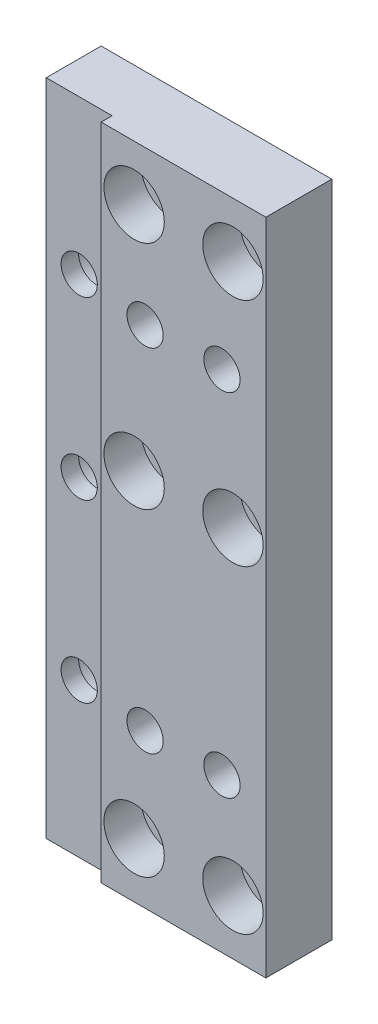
ISO-10303-21;
HEADER;
FILE_DESCRIPTION(('STEP AP214'),'2;1');
FILE_NAME('part.step','',(''),(''),'','','');
FILE_SCHEMA(('AUTOMOTIVE_DESIGN { 1 0 10303 214 1 1 1 1 }'));
ENDSEC;
DATA;
#1=APPLICATION_CONTEXT('core data for automotive mechanical design processes');
#2=APPLICATION_PROTOCOL_DEFINITION('international standard','automotive_design',2000,#1);
#3=PRODUCT_CONTEXT('',#1,'mechanical');
#4=PRODUCT('Part','Part','',(#3));
#5=PRODUCT_RELATED_PRODUCT_CATEGORY('part','',(#4));
#6=PRODUCT_DEFINITION_FORMATION('','',#4);
#7=PRODUCT_DEFINITION_CONTEXT('part definition',#1,'design');
#8=PRODUCT_DEFINITION('design','',#6,#7);
#9=PRODUCT_DEFINITION_SHAPE('','',#8);
#10=(LENGTH_UNIT() NAMED_UNIT(*) SI_UNIT(.MILLI.,.METRE.));
#11=(NAMED_UNIT(*) PLANE_ANGLE_UNIT() SI_UNIT($,.RADIAN.));
#12=(NAMED_UNIT(*) SI_UNIT($,.STERADIAN.) SOLID_ANGLE_UNIT());
#13=UNCERTAINTY_MEASURE_WITH_UNIT(LENGTH_MEASURE(1.E-05),#10,'distance_accuracy_value','');
#14=(GEOMETRIC_REPRESENTATION_CONTEXT(3) GLOBAL_UNCERTAINTY_ASSIGNED_CONTEXT((#13)) GLOBAL_UNIT_ASSIGNED_CONTEXT((#10,
#11,#12)) REPRESENTATION_CONTEXT('',''));
#15=CARTESIAN_POINT('',(0.,0.,0.));
#16=DIRECTION('',(0.,0.,1.));
#17=DIRECTION('',(1.,0.,0.));
#18=AXIS2_PLACEMENT_3D('',#15,#16,#17);
#19=CARTESIAN_POINT('',(-30.,60.,12.));
#20=DIRECTION('',(0.,-1.,0.));
#21=DIRECTION('',(0.,0.,-1.));
#22=AXIS2_PLACEMENT_3D('',#19,#20,#21);
#23=PLANE('',#22);
#24=DIRECTION('',(-1.,0.,0.));
#25=VECTOR('',#24,1.);
#26=CARTESIAN_POINT('',(-30.,60.,12.));
#27=LINE('',#26,#25);
#28=CARTESIAN_POINT('',(12.,60.,12.));
#29=VERTEX_POINT('',#28);
#30=CARTESIAN_POINT('',(-18.,60.,12.));
#31=VERTEX_POINT('',#30);
#32=EDGE_CURVE('E88',#29,#31,#27,.T.);
#33=ORIENTED_EDGE('',*,*,#32,.F.);
#34=DIRECTION('',(0.,0.,-1.));
#35=VECTOR('',#34,1.);
#36=CARTESIAN_POINT('',(12.,60.,12.));
#37=LINE('',#36,#35);
#38=CARTESIAN_POINT('',(12.,60.,0.));
#39=VERTEX_POINT('',#38);
#40=EDGE_CURVE('E72',#29,#39,#37,.T.);
#41=ORIENTED_EDGE('',*,*,#40,.T.);
#42=DIRECTION('',(-1.,0.,0.));
#43=VECTOR('',#42,1.);
#44=CARTESIAN_POINT('',(-30.,60.,0.));
#45=LINE('',#44,#43);
#46=CARTESIAN_POINT('',(-30.,60.,0.));
#47=VERTEX_POINT('',#46);
#48=EDGE_CURVE('E94',#39,#47,#45,.T.);
#49=ORIENTED_EDGE('',*,*,#48,.T.);
#50=DIRECTION('',(0.,0.,-1.));
#51=VECTOR('',#50,1.);
#52=CARTESIAN_POINT('',(-30.,60.,12.));
#53=LINE('',#52,#51);
#54=CARTESIAN_POINT('',(-30.,60.,10.));
#55=VERTEX_POINT('',#54);
#56=EDGE_CURVE('E24',#55,#47,#53,.T.);
#57=ORIENTED_EDGE('',*,*,#56,.F.);
#58=DIRECTION('',(1.,0.,0.));
#59=VECTOR('',#58,1.);
#60=CARTESIAN_POINT('',(-18.,60.,10.));
#61=LINE('',#60,#59);
#62=CARTESIAN_POINT('',(-18.,60.,10.));
#63=VERTEX_POINT('',#62);
#64=EDGE_CURVE('E182',#55,#63,#61,.T.);
#65=ORIENTED_EDGE('',*,*,#64,.T.);
#66=DIRECTION('',(0.,0.,1.));
#67=VECTOR('',#66,1.);
#68=CARTESIAN_POINT('',(-18.,60.,10.));
#69=LINE('',#68,#67);
#70=EDGE_CURVE('E179',#63,#31,#69,.T.);
#71=ORIENTED_EDGE('',*,*,#70,.T.);
#72=EDGE_LOOP('',(#33,#41,#49,#57,#65,#71));
#73=FACE_BOUND('',#72,.T.);
#74=ADVANCED_FACE('F16',(#73),#23,.F.);
#75=CARTESIAN_POINT('',(-30.,60.,12.));
#76=DIRECTION('',(1.,0.,0.));
#77=DIRECTION('',(0.,1.,0.));
#78=AXIS2_PLACEMENT_3D('',#75,#76,#77);
#79=PLANE('',#78);
#80=DIRECTION('',(0.,0.,-1.));
#81=VECTOR('',#80,1.);
#82=CARTESIAN_POINT('',(-30.,-60.,12.));
#83=LINE('',#82,#81);
#84=CARTESIAN_POINT('',(-30.,-60.,10.));
#85=VERTEX_POINT('',#84);
#86=CARTESIAN_POINT('',(-30.,-60.,0.));
#87=VERTEX_POINT('',#86);
#88=EDGE_CURVE('E87',#85,#87,#83,.T.);
#89=ORIENTED_EDGE('',*,*,#88,.F.);
#90=DIRECTION('',(0.,1.,0.));
#91=VECTOR('',#90,1.);
#92=CARTESIAN_POINT('',(-30.,60.,10.));
#93=LINE('',#92,#91);
#94=EDGE_CURVE('E97',#85,#55,#93,.T.);
#95=ORIENTED_EDGE('',*,*,#94,.T.);
#96=ORIENTED_EDGE('',*,*,#56,.T.);
#97=DIRECTION('',(0.,-1.,0.));
#98=VECTOR('',#97,1.);
#99=CARTESIAN_POINT('',(-30.,60.,0.));
#100=LINE('',#99,#98);
#101=EDGE_CURVE('E96',#47,#87,#100,.T.);
#102=ORIENTED_EDGE('',*,*,#101,.T.);
#103=EDGE_LOOP('',(#89,#95,#96,#102));
#104=FACE_BOUND('',#103,.T.);
#105=ADVANCED_FACE('F193',(#104),#79,.F.);
#106=CARTESIAN_POINT('',(-30.,-60.,12.));
#107=DIRECTION('',(0.,1.,0.));
#108=DIRECTION('',(0.,0.,1.));
#109=AXIS2_PLACEMENT_3D('',#106,#107,#108);
#110=PLANE('',#109);
#111=DIRECTION('',(1.,0.,0.));
#112=VECTOR('',#111,1.);
#113=CARTESIAN_POINT('',(-30.,-60.,0.));
#114=LINE('',#113,#112);
#115=CARTESIAN_POINT('',(12.,-60.,0.));
#116=VERTEX_POINT('',#115);
#117=EDGE_CURVE('E84',#87,#116,#114,.T.);
#118=ORIENTED_EDGE('',*,*,#117,.T.);
#119=DIRECTION('',(0.,0.,-1.));
#120=VECTOR('',#119,1.);
#121=CARTESIAN_POINT('',(12.,-60.,12.));
#122=LINE('',#121,#120);
#123=CARTESIAN_POINT('',(12.,-60.,12.));
#124=VERTEX_POINT('',#123);
#125=EDGE_CURVE('E32',#124,#116,#122,.T.);
#126=ORIENTED_EDGE('',*,*,#125,.F.);
#127=DIRECTION('',(1.,0.,0.));
#128=VECTOR('',#127,1.);
#129=CARTESIAN_POINT('',(-30.,-60.,12.));
#130=LINE('',#129,#128);
#131=CARTESIAN_POINT('',(-18.,-60.,12.));
#132=VERTEX_POINT('',#131);
#133=EDGE_CURVE('E82',#132,#124,#130,.T.);
#134=ORIENTED_EDGE('',*,*,#133,.F.);
#135=DIRECTION('',(0.,0.,1.));
#136=VECTOR('',#135,1.);
#137=CARTESIAN_POINT('',(-18.,-60.,10.));
#138=LINE('',#137,#136);
#139=CARTESIAN_POINT('',(-18.,-60.,10.));
#140=VERTEX_POINT('',#139);
#141=EDGE_CURVE('E39',#140,#132,#138,.T.);
#142=ORIENTED_EDGE('',*,*,#141,.F.);
#143=DIRECTION('',(1.,0.,0.));
#144=VECTOR('',#143,1.);
#145=CARTESIAN_POINT('',(-18.,-60.,10.));
#146=LINE('',#145,#144);
#147=EDGE_CURVE('E183',#85,#140,#146,.T.);
#148=ORIENTED_EDGE('',*,*,#147,.F.);
#149=ORIENTED_EDGE('',*,*,#88,.T.);
#150=EDGE_LOOP('',(#118,#126,#134,#142,#148,#149));
#151=FACE_BOUND('',#150,.T.);
#152=ADVANCED_FACE('F81',(#151),#110,.F.);
#153=CARTESIAN_POINT('',(0.,0.,12.));
#154=DIRECTION('',(0.,0.,1.));
#155=DIRECTION('',(1.,0.,0.));
#156=AXIS2_PLACEMENT_3D('',#153,#154,#155);
#157=PLANE('',#156);
#158=CARTESIAN_POINT('',(-12.,-50.,12.));
#159=DIRECTION('',(0.,0.,1.));
#160=DIRECTION('',(1.,0.,0.));
#161=AXIS2_PLACEMENT_3D('',#158,#159,#160);
#162=CIRCLE('',#161,5.5);
#163=CARTESIAN_POINT('',(-6.5,-50.,12.));
#164=VERTEX_POINT('',#163);
#165=EDGE_CURVE('E667',#164,#164,#162,.T.);
#166=ORIENTED_EDGE('',*,*,#165,.F.);
#167=EDGE_LOOP('',(#166));
#168=FACE_BOUND('',#167,.T.);
#169=CARTESIAN_POINT('',(6.,-50.,12.));
#170=DIRECTION('',(0.,0.,1.));
#171=DIRECTION('',(1.,0.,0.));
#172=AXIS2_PLACEMENT_3D('',#169,#170,#171);
#173=CIRCLE('',#172,5.5);
#174=CARTESIAN_POINT('',(11.5,-50.,12.));
#175=VERTEX_POINT('',#174);
#176=EDGE_CURVE('E676',#175,#175,#173,.T.);
#177=ORIENTED_EDGE('',*,*,#176,.F.);
#178=EDGE_LOOP('',(#177));
#179=FACE_BOUND('',#178,.T.);
#180=CARTESIAN_POINT('',(-12.,50.,12.));
#181=DIRECTION('',(0.,0.,1.));
#182=DIRECTION('',(1.,0.,0.));
#183=AXIS2_PLACEMENT_3D('',#180,#181,#182);
#184=CIRCLE('',#183,5.5);
#185=CARTESIAN_POINT('',(-6.5,50.,12.));
#186=VERTEX_POINT('',#185);
#187=EDGE_CURVE('E688',#186,#186,#184,.T.);
#188=ORIENTED_EDGE('',*,*,#187,.F.);
#189=EDGE_LOOP('',(#188));
#190=FACE_BOUND('',#189,.T.);
#191=CARTESIAN_POINT('',(6.,50.,12.));
#192=DIRECTION('',(0.,0.,1.));
#193=DIRECTION('',(1.,0.,0.));
#194=AXIS2_PLACEMENT_3D('',#191,#192,#193);
#195=CIRCLE('',#194,5.5);
#196=CARTESIAN_POINT('',(11.5,50.,12.));
#197=VERTEX_POINT('',#196);
#198=EDGE_CURVE('E700',#197,#197,#195,.T.);
#199=ORIENTED_EDGE('',*,*,#198,.F.);
#200=EDGE_LOOP('',(#199));
#201=FACE_BOUND('',#200,.T.);
#202=CARTESIAN_POINT('',(6.,8.,12.));
#203=DIRECTION('',(0.,0.,1.));
#204=DIRECTION('',(1.,0.,0.));
#205=AXIS2_PLACEMENT_3D('',#202,#203,#204);
#206=CIRCLE('',#205,5.5);
#207=CARTESIAN_POINT('',(11.5,8.,12.));
#208=VERTEX_POINT('',#207);
#209=EDGE_CURVE('E712',#208,#208,#206,.T.);
#210=ORIENTED_EDGE('',*,*,#209,.F.);
#211=EDGE_LOOP('',(#210));
#212=FACE_BOUND('',#211,.T.);
#213=CARTESIAN_POINT('',(-12.,8.,12.));
#214=DIRECTION('',(0.,0.,1.));
#215=DIRECTION('',(1.,0.,0.));
#216=AXIS2_PLACEMENT_3D('',#213,#214,#215);
#217=CIRCLE('',#216,5.5);
#218=CARTESIAN_POINT('',(-6.5,8.,12.));
#219=VERTEX_POINT('',#218);
#220=EDGE_CURVE('E724',#219,#219,#217,.T.);
#221=ORIENTED_EDGE('',*,*,#220,.F.);
#222=EDGE_LOOP('',(#221));
#223=FACE_BOUND('',#222,.T.);
#224=CARTESIAN_POINT('',(-10.,-32.,12.));
#225=DIRECTION('',(0.,0.,-1.));
#226=DIRECTION('',(-1.,0.,0.));
#227=AXIS2_PLACEMENT_3D('',#224,#225,#226);
#228=CIRCLE('',#227,3.3);
#229=CARTESIAN_POINT('',(-13.3,-32.,12.));
#230=VERTEX_POINT('',#229);
#231=EDGE_CURVE('E138',#230,#230,#228,.T.);
#232=ORIENTED_EDGE('',*,*,#231,.T.);
#233=EDGE_LOOP('',(#232));
#234=FACE_BOUND('',#233,.T.);
#235=CARTESIAN_POINT('',(4.,-32.,12.));
#236=DIRECTION('',(0.,0.,-1.));
#237=DIRECTION('',(-1.,0.,0.));
#238=AXIS2_PLACEMENT_3D('',#235,#236,#237);
#239=CIRCLE('',#238,3.3);
#240=CARTESIAN_POINT('',(0.7,-32.,12.));
#241=VERTEX_POINT('',#240);
#242=EDGE_CURVE('E150',#241,#241,#239,.T.);
#243=ORIENTED_EDGE('',*,*,#242,.T.);
#244=EDGE_LOOP('',(#243));
#245=FACE_BOUND('',#244,.T.);
#246=CARTESIAN_POINT('',(-10.,32.,12.));
#247=DIRECTION('',(0.,0.,-1.));
#248=DIRECTION('',(-1.,0.,0.));
#249=AXIS2_PLACEMENT_3D('',#246,#247,#248);
#250=CIRCLE('',#249,3.3);
#251=CARTESIAN_POINT('',(-13.3,32.,12.));
#252=VERTEX_POINT('',#251);
#253=EDGE_CURVE('E162',#252,#252,#250,.T.);
#254=ORIENTED_EDGE('',*,*,#253,.T.);
#255=EDGE_LOOP('',(#254));
#256=FACE_BOUND('',#255,.T.);
#257=CARTESIAN_POINT('',(4.,32.,12.));
#258=DIRECTION('',(0.,0.,-1.));
#259=DIRECTION('',(-1.,0.,0.));
#260=AXIS2_PLACEMENT_3D('',#257,#258,#259);
#261=CIRCLE('',#260,3.3);
#262=CARTESIAN_POINT('',(0.7,32.,12.));
#263=VERTEX_POINT('',#262);
#264=EDGE_CURVE('E174',#263,#263,#261,.T.);
#265=ORIENTED_EDGE('',*,*,#264,.T.);
#266=EDGE_LOOP('',(#265));
#267=FACE_BOUND('',#266,.T.);
#268=DIRECTION('',(0.,1.,0.));
#269=VECTOR('',#268,1.);
#270=CARTESIAN_POINT('',(12.,60.,12.));
#271=LINE('',#270,#269);
#272=EDGE_CURVE('E69',#124,#29,#271,.T.);
#273=ORIENTED_EDGE('',*,*,#272,.T.);
#274=ORIENTED_EDGE('',*,*,#32,.T.);
#275=DIRECTION('',(0.,1.,0.));
#276=VECTOR('',#275,1.);
#277=CARTESIAN_POINT('',(-18.,0.,12.));
#278=LINE('',#277,#276);
#279=EDGE_CURVE('E11',#132,#31,#278,.T.);
#280=ORIENTED_EDGE('',*,*,#279,.F.);
#281=ORIENTED_EDGE('',*,*,#133,.T.);
#282=EDGE_LOOP('',(#273,#274,#280,#281));
#283=FACE_BOUND('',#282,.T.);
#284=ADVANCED_FACE('F86',(#168,#179,#190,#201,#212,#223,#234,#245,#256,#267,#283),#157,.T.);
#285=CARTESIAN_POINT('',(0.,0.,0.));
#286=DIRECTION('',(0.,0.,1.));
#287=DIRECTION('',(1.,0.,0.));
#288=AXIS2_PLACEMENT_3D('',#285,#286,#287);
#289=PLANE('',#288);
#290=CARTESIAN_POINT('',(-12.,-50.,0.));
#291=DIRECTION('',(0.,0.,1.));
#292=DIRECTION('',(1.,0.,0.));
#293=AXIS2_PLACEMENT_3D('',#290,#291,#292);
#294=CIRCLE('',#293,3.3);
#295=CARTESIAN_POINT('',(-8.7,-50.,0.));
#296=VERTEX_POINT('',#295);
#297=EDGE_CURVE('E674',#296,#296,#294,.T.);
#298=ORIENTED_EDGE('',*,*,#297,.T.);
#299=EDGE_LOOP('',(#298));
#300=FACE_BOUND('',#299,.T.);
#301=CARTESIAN_POINT('',(6.,-50.,0.));
#302=DIRECTION('',(0.,0.,1.));
#303=DIRECTION('',(1.,0.,0.));
#304=AXIS2_PLACEMENT_3D('',#301,#302,#303);
#305=CIRCLE('',#304,3.3);
#306=CARTESIAN_POINT('',(9.3,-50.,0.));
#307=VERTEX_POINT('',#306);
#308=EDGE_CURVE('E685',#307,#307,#305,.T.);
#309=ORIENTED_EDGE('',*,*,#308,.T.);
#310=EDGE_LOOP('',(#309));
#311=FACE_BOUND('',#310,.T.);
#312=CARTESIAN_POINT('',(-12.,50.,0.));
#313=DIRECTION('',(0.,0.,1.));
#314=DIRECTION('',(1.,0.,0.));
#315=AXIS2_PLACEMENT_3D('',#312,#313,#314);
#316=CIRCLE('',#315,3.3);
#317=CARTESIAN_POINT('',(-8.7,50.,0.));
#318=VERTEX_POINT('',#317);
#319=EDGE_CURVE('E697',#318,#318,#316,.T.);
#320=ORIENTED_EDGE('',*,*,#319,.T.);
#321=EDGE_LOOP('',(#320));
#322=FACE_BOUND('',#321,.T.);
#323=CARTESIAN_POINT('',(6.,50.,0.));
#324=DIRECTION('',(0.,0.,1.));
#325=DIRECTION('',(1.,0.,0.));
#326=AXIS2_PLACEMENT_3D('',#323,#324,#325);
#327=CIRCLE('',#326,3.3);
#328=CARTESIAN_POINT('',(9.3,50.,0.));
#329=VERTEX_POINT('',#328);
#330=EDGE_CURVE('E709',#329,#329,#327,.T.);
#331=ORIENTED_EDGE('',*,*,#330,.T.);
#332=EDGE_LOOP('',(#331));
#333=FACE_BOUND('',#332,.T.);
#334=CARTESIAN_POINT('',(6.,8.,0.));
#335=DIRECTION('',(0.,0.,1.));
#336=DIRECTION('',(1.,0.,0.));
#337=AXIS2_PLACEMENT_3D('',#334,#335,#336);
#338=CIRCLE('',#337,3.3);
#339=CARTESIAN_POINT('',(9.3,8.,0.));
#340=VERTEX_POINT('',#339);
#341=EDGE_CURVE('E721',#340,#340,#338,.T.);
#342=ORIENTED_EDGE('',*,*,#341,.T.);
#343=EDGE_LOOP('',(#342));
#344=FACE_BOUND('',#343,.T.);
#345=CARTESIAN_POINT('',(-12.,8.,0.));
#346=DIRECTION('',(0.,0.,1.));
#347=DIRECTION('',(1.,0.,0.));
#348=AXIS2_PLACEMENT_3D('',#345,#346,#347);
#349=CIRCLE('',#348,3.3);
#350=CARTESIAN_POINT('',(-8.7,8.,0.));
#351=VERTEX_POINT('',#350);
#352=EDGE_CURVE('E733',#351,#351,#349,.T.);
#353=ORIENTED_EDGE('',*,*,#352,.T.);
#354=EDGE_LOOP('',(#353));
#355=FACE_BOUND('',#354,.T.);
#356=CARTESIAN_POINT('',(-24.,32.,0.));
#357=DIRECTION('',(0.,0.,-1.));
#358=DIRECTION('',(-1.,0.,0.));
#359=AXIS2_PLACEMENT_3D('',#356,#357,#358);
#360=CIRCLE('',#359,5.5);
#361=CARTESIAN_POINT('',(-29.5,32.,0.));
#362=VERTEX_POINT('',#361);
#363=EDGE_CURVE('E736',#362,#362,#360,.T.);
#364=ORIENTED_EDGE('',*,*,#363,.F.);
#365=EDGE_LOOP('',(#364));
#366=FACE_BOUND('',#365,.T.);
#367=CARTESIAN_POINT('',(-24.,0.,0.));
#368=DIRECTION('',(0.,0.,-1.));
#369=DIRECTION('',(-1.,0.,0.));
#370=AXIS2_PLACEMENT_3D('',#367,#368,#369);
#371=CIRCLE('',#370,5.5);
#372=CARTESIAN_POINT('',(-29.5,0.,0.));
#373=VERTEX_POINT('',#372);
#374=EDGE_CURVE('E122',#373,#373,#371,.T.);
#375=ORIENTED_EDGE('',*,*,#374,.F.);
#376=EDGE_LOOP('',(#375));
#377=FACE_BOUND('',#376,.T.);
#378=CARTESIAN_POINT('',(-24.,-32.,0.));
#379=DIRECTION('',(0.,0.,-1.));
#380=DIRECTION('',(-1.,0.,0.));
#381=AXIS2_PLACEMENT_3D('',#378,#379,#380);
#382=CIRCLE('',#381,5.5);
#383=CARTESIAN_POINT('',(-29.5,-32.,0.));
#384=VERTEX_POINT('',#383);
#385=EDGE_CURVE('E109',#384,#384,#382,.T.);
#386=ORIENTED_EDGE('',*,*,#385,.F.);
#387=EDGE_LOOP('',(#386));
#388=FACE_BOUND('',#387,.T.);
#389=CARTESIAN_POINT('',(-10.,-32.,0.));
#390=DIRECTION('',(0.,0.,-1.));
#391=DIRECTION('',(-1.,0.,0.));
#392=AXIS2_PLACEMENT_3D('',#389,#390,#391);
#393=CIRCLE('',#392,5.5);
#394=CARTESIAN_POINT('',(-15.5,-32.,0.));
#395=VERTEX_POINT('',#394);
#396=EDGE_CURVE('E105',#395,#395,#393,.T.);
#397=ORIENTED_EDGE('',*,*,#396,.F.);
#398=EDGE_LOOP('',(#397));
#399=FACE_BOUND('',#398,.T.);
#400=CARTESIAN_POINT('',(4.,-32.,0.));
#401=DIRECTION('',(0.,0.,-1.));
#402=DIRECTION('',(-1.,0.,0.));
#403=AXIS2_PLACEMENT_3D('',#400,#401,#402);
#404=CIRCLE('',#403,5.5);
#405=CARTESIAN_POINT('',(-1.5,-32.,0.));
#406=VERTEX_POINT('',#405);
#407=EDGE_CURVE('E141',#406,#406,#404,.T.);
#408=ORIENTED_EDGE('',*,*,#407,.F.);
#409=EDGE_LOOP('',(#408));
#410=FACE_BOUND('',#409,.T.);
#411=CARTESIAN_POINT('',(-10.,32.,0.));
#412=DIRECTION('',(0.,0.,-1.));
#413=DIRECTION('',(-1.,0.,0.));
#414=AXIS2_PLACEMENT_3D('',#411,#412,#413);
#415=CIRCLE('',#414,5.5);
#416=CARTESIAN_POINT('',(-15.5,32.,0.));
#417=VERTEX_POINT('',#416);
#418=EDGE_CURVE('E153',#417,#417,#415,.T.);
#419=ORIENTED_EDGE('',*,*,#418,.F.);
#420=EDGE_LOOP('',(#419));
#421=FACE_BOUND('',#420,.T.);
#422=CARTESIAN_POINT('',(4.,32.,0.));
#423=DIRECTION('',(0.,0.,-1.));
#424=DIRECTION('',(-1.,0.,0.));
#425=AXIS2_PLACEMENT_3D('',#422,#423,#424);
#426=CIRCLE('',#425,5.5);
#427=CARTESIAN_POINT('',(-1.5,32.,0.));
#428=VERTEX_POINT('',#427);
#429=EDGE_CURVE('E165',#428,#428,#426,.T.);
#430=ORIENTED_EDGE('',*,*,#429,.F.);
#431=EDGE_LOOP('',(#430));
#432=FACE_BOUND('',#431,.T.);
#433=ORIENTED_EDGE('',*,*,#48,.F.);
#434=DIRECTION('',(0.,1.,0.));
#435=VECTOR('',#434,1.);
#436=CARTESIAN_POINT('',(12.,60.,0.));
#437=LINE('',#436,#435);
#438=EDGE_CURVE('E76',#116,#39,#437,.T.);
#439=ORIENTED_EDGE('',*,*,#438,.F.);
#440=ORIENTED_EDGE('',*,*,#117,.F.);
#441=ORIENTED_EDGE('',*,*,#101,.F.);
#442=EDGE_LOOP('',(#433,#439,#440,#441));
#443=FACE_BOUND('',#442,.T.);
#444=ADVANCED_FACE('F200',(#300,#311,#322,#333,#344,#355,#366,#377,#388,#399,#410,#421,#432,
#443),#289,.F.);
#445=CARTESIAN_POINT('',(-18.,60.,10.));
#446=DIRECTION('',(0.,0.,-1.));
#447=DIRECTION('',(-1.,0.,0.));
#448=AXIS2_PLACEMENT_3D('',#445,#446,#447);
#449=PLANE('',#448);
#450=CARTESIAN_POINT('',(-24.,32.,10.));
#451=DIRECTION('',(0.,0.,-1.));
#452=DIRECTION('',(-1.,0.,0.));
#453=AXIS2_PLACEMENT_3D('',#450,#451,#452);
#454=CIRCLE('',#453,3.3);
#455=CARTESIAN_POINT('',(-27.3,32.,10.));
#456=VERTEX_POINT('',#455);
#457=EDGE_CURVE('E19',#456,#456,#454,.T.);
#458=ORIENTED_EDGE('',*,*,#457,.T.);
#459=EDGE_LOOP('',(#458));
#460=FACE_BOUND('',#459,.T.);
#461=CARTESIAN_POINT('',(-24.,0.,10.));
#462=DIRECTION('',(0.,0.,-1.));
#463=DIRECTION('',(-1.,0.,0.));
#464=AXIS2_PLACEMENT_3D('',#461,#462,#463);
#465=CIRCLE('',#464,3.3);
#466=CARTESIAN_POINT('',(-27.3,0.,10.));
#467=VERTEX_POINT('',#466);
#468=EDGE_CURVE('E107',#467,#467,#465,.T.);
#469=ORIENTED_EDGE('',*,*,#468,.T.);
#470=EDGE_LOOP('',(#469));
#471=FACE_BOUND('',#470,.T.);
#472=CARTESIAN_POINT('',(-24.,-32.,10.));
#473=DIRECTION('',(0.,0.,-1.));
#474=DIRECTION('',(-1.,0.,0.));
#475=AXIS2_PLACEMENT_3D('',#472,#473,#474);
#476=CIRCLE('',#475,3.3);
#477=CARTESIAN_POINT('',(-27.3,-32.,10.));
#478=VERTEX_POINT('',#477);
#479=EDGE_CURVE('E103',#478,#478,#476,.T.);
#480=ORIENTED_EDGE('',*,*,#479,.T.);
#481=EDGE_LOOP('',(#480));
#482=FACE_BOUND('',#481,.T.);
#483=ORIENTED_EDGE('',*,*,#147,.T.);
#484=DIRECTION('',(0.,-1.,0.));
#485=VECTOR('',#484,1.);
#486=CARTESIAN_POINT('',(-18.,60.,10.));
#487=LINE('',#486,#485);
#488=EDGE_CURVE('E186',#63,#140,#487,.T.);
#489=ORIENTED_EDGE('',*,*,#488,.F.);
#490=ORIENTED_EDGE('',*,*,#64,.F.);
#491=ORIENTED_EDGE('',*,*,#94,.F.);
#492=EDGE_LOOP('',(#483,#489,#490,#491));
#493=FACE_BOUND('',#492,.T.);
#494=ADVANCED_FACE('F202',(#460,#471,#482,#493),#449,.F.);
#495=CARTESIAN_POINT('',(-18.,60.,10.));
#496=DIRECTION('',(1.,0.,0.));
#497=DIRECTION('',(0.,0.,-1.));
#498=AXIS2_PLACEMENT_3D('',#495,#496,#497);
#499=PLANE('',#498);
#500=ORIENTED_EDGE('',*,*,#279,.T.);
#501=ORIENTED_EDGE('',*,*,#70,.F.);
#502=ORIENTED_EDGE('',*,*,#488,.T.);
#503=ORIENTED_EDGE('',*,*,#141,.T.);
#504=EDGE_LOOP('',(#500,#501,#502,#503));
#505=FACE_BOUND('',#504,.T.);
#506=ADVANCED_FACE('F211',(#505),#499,.F.);
#507=CARTESIAN_POINT('',(12.,60.,12.));
#508=DIRECTION('',(-1.,0.,0.));
#509=DIRECTION('',(0.,-1.,0.));
#510=AXIS2_PLACEMENT_3D('',#507,#508,#509);
#511=PLANE('',#510);
#512=ORIENTED_EDGE('',*,*,#438,.T.);
#513=ORIENTED_EDGE('',*,*,#40,.F.);
#514=ORIENTED_EDGE('',*,*,#272,.F.);
#515=ORIENTED_EDGE('',*,*,#125,.T.);
#516=EDGE_LOOP('',(#512,#513,#514,#515));
#517=FACE_BOUND('',#516,.T.);
#518=ADVANCED_FACE('F70',(#517),#511,.F.);
#519=CARTESIAN_POINT('',(4.,32.,0.));
#520=DIRECTION('',(0.,0.,-1.));
#521=DIRECTION('',(-1.,0.,0.));
#522=AXIS2_PLACEMENT_3D('',#519,#520,#521);
#523=CYLINDRICAL_SURFACE('',#522,3.3);
#524=ORIENTED_EDGE('',*,*,#264,.F.);
#525=EDGE_LOOP('',(#524));
#526=FACE_BOUND('',#525,.T.);
#527=CARTESIAN_POINT('',(4.,32.,6.8));
#528=DIRECTION('',(0.,0.,-1.));
#529=DIRECTION('',(-1.,0.,0.));
#530=AXIS2_PLACEMENT_3D('',#527,#528,#529);
#531=CIRCLE('',#530,3.3);
#532=CARTESIAN_POINT('',(0.7,32.,6.8));
#533=VERTEX_POINT('',#532);
#534=EDGE_CURVE('E171',#533,#533,#531,.T.);
#535=ORIENTED_EDGE('',*,*,#534,.T.);
#536=EDGE_LOOP('',(#535));
#537=FACE_BOUND('',#536,.T.);
#538=ADVANCED_FACE('F267',(#526,#537),#523,.F.);
#539=CARTESIAN_POINT('',(7.3,32.,6.8));
#540=DIRECTION('',(0.,0.,1.));
#541=DIRECTION('',(1.,0.,0.));
#542=AXIS2_PLACEMENT_3D('',#539,#540,#541);
#543=PLANE('',#542);
#544=ORIENTED_EDGE('',*,*,#534,.F.);
#545=EDGE_LOOP('',(#544));
#546=FACE_BOUND('',#545,.T.);
#547=CARTESIAN_POINT('',(4.,32.,6.8));
#548=DIRECTION('',(0.,0.,-1.));
#549=DIRECTION('',(-1.,0.,0.));
#550=AXIS2_PLACEMENT_3D('',#547,#548,#549);
#551=CIRCLE('',#550,5.5);
#552=CARTESIAN_POINT('',(-1.5,32.,6.8));
#553=VERTEX_POINT('',#552);
#554=EDGE_CURVE('E168',#553,#553,#551,.T.);
#555=ORIENTED_EDGE('',*,*,#554,.T.);
#556=EDGE_LOOP('',(#555));
#557=FACE_BOUND('',#556,.T.);
#558=ADVANCED_FACE('F276',(#546,#557),#543,.F.);
#559=CARTESIAN_POINT('',(4.,32.,0.));
#560=DIRECTION('',(0.,0.,-1.));
#561=DIRECTION('',(-1.,0.,0.));
#562=AXIS2_PLACEMENT_3D('',#559,#560,#561);
#563=CYLINDRICAL_SURFACE('',#562,5.5);
#564=ORIENTED_EDGE('',*,*,#554,.F.);
#565=EDGE_LOOP('',(#564));
#566=FACE_BOUND('',#565,.T.);
#567=ORIENTED_EDGE('',*,*,#429,.T.);
#568=EDGE_LOOP('',(#567));
#569=FACE_BOUND('',#568,.T.);
#570=ADVANCED_FACE('F286',(#566,#569),#563,.F.);
#571=CARTESIAN_POINT('',(-10.,32.,0.));
#572=DIRECTION('',(0.,0.,-1.));
#573=DIRECTION('',(-1.,0.,0.));
#574=AXIS2_PLACEMENT_3D('',#571,#572,#573);
#575=CYLINDRICAL_SURFACE('',#574,3.3);
#576=ORIENTED_EDGE('',*,*,#253,.F.);
#577=EDGE_LOOP('',(#576));
#578=FACE_BOUND('',#577,.T.);
#579=CARTESIAN_POINT('',(-10.,32.,6.8));
#580=DIRECTION('',(0.,0.,-1.));
#581=DIRECTION('',(-1.,0.,0.));
#582=AXIS2_PLACEMENT_3D('',#579,#580,#581);
#583=CIRCLE('',#582,3.3);
#584=CARTESIAN_POINT('',(-13.3,32.,6.8));
#585=VERTEX_POINT('',#584);
#586=EDGE_CURVE('E159',#585,#585,#583,.T.);
#587=ORIENTED_EDGE('',*,*,#586,.T.);
#588=EDGE_LOOP('',(#587));
#589=FACE_BOUND('',#588,.T.);
#590=ADVANCED_FACE('F296',(#578,#589),#575,.F.);
#591=CARTESIAN_POINT('',(-6.7,32.,6.8));
#592=DIRECTION('',(0.,0.,1.));
#593=DIRECTION('',(1.,0.,0.));
#594=AXIS2_PLACEMENT_3D('',#591,#592,#593);
#595=PLANE('',#594);
#596=ORIENTED_EDGE('',*,*,#586,.F.);
#597=EDGE_LOOP('',(#596));
#598=FACE_BOUND('',#597,.T.);
#599=CARTESIAN_POINT('',(-10.,32.,6.8));
#600=DIRECTION('',(0.,0.,-1.));
#601=DIRECTION('',(-1.,0.,0.));
#602=AXIS2_PLACEMENT_3D('',#599,#600,#601);
#603=CIRCLE('',#602,5.5);
#604=CARTESIAN_POINT('',(-15.5,32.,6.8));
#605=VERTEX_POINT('',#604);
#606=EDGE_CURVE('E156',#605,#605,#603,.T.);
#607=ORIENTED_EDGE('',*,*,#606,.T.);
#608=EDGE_LOOP('',(#607));
#609=FACE_BOUND('',#608,.T.);
#610=ADVANCED_FACE('F306',(#598,#609),#595,.F.);
#611=CARTESIAN_POINT('',(-10.,32.,0.));
#612=DIRECTION('',(0.,0.,-1.));
#613=DIRECTION('',(-1.,0.,0.));
#614=AXIS2_PLACEMENT_3D('',#611,#612,#613);
#615=CYLINDRICAL_SURFACE('',#614,5.5);
#616=ORIENTED_EDGE('',*,*,#606,.F.);
#617=EDGE_LOOP('',(#616));
#618=FACE_BOUND('',#617,.T.);
#619=ORIENTED_EDGE('',*,*,#418,.T.);
#620=EDGE_LOOP('',(#619));
#621=FACE_BOUND('',#620,.T.);
#622=ADVANCED_FACE('F316',(#618,#621),#615,.F.);
#623=CARTESIAN_POINT('',(4.,-32.,0.));
#624=DIRECTION('',(0.,0.,-1.));
#625=DIRECTION('',(-1.,0.,0.));
#626=AXIS2_PLACEMENT_3D('',#623,#624,#625);
#627=CYLINDRICAL_SURFACE('',#626,3.3);
#628=ORIENTED_EDGE('',*,*,#242,.F.);
#629=EDGE_LOOP('',(#628));
#630=FACE_BOUND('',#629,.T.);
#631=CARTESIAN_POINT('',(4.,-32.,6.8));
#632=DIRECTION('',(0.,0.,-1.));
#633=DIRECTION('',(-1.,0.,0.));
#634=AXIS2_PLACEMENT_3D('',#631,#632,#633);
#635=CIRCLE('',#634,3.3);
#636=CARTESIAN_POINT('',(0.7,-32.,6.8));
#637=VERTEX_POINT('',#636);
#638=EDGE_CURVE('E147',#637,#637,#635,.T.);
#639=ORIENTED_EDGE('',*,*,#638,.T.);
#640=EDGE_LOOP('',(#639));
#641=FACE_BOUND('',#640,.T.);
#642=ADVANCED_FACE('F326',(#630,#641),#627,.F.);
#643=CARTESIAN_POINT('',(7.3,-32.,6.8));
#644=DIRECTION('',(0.,0.,1.));
#645=DIRECTION('',(1.,0.,0.));
#646=AXIS2_PLACEMENT_3D('',#643,#644,#645);
#647=PLANE('',#646);
#648=ORIENTED_EDGE('',*,*,#638,.F.);
#649=EDGE_LOOP('',(#648));
#650=FACE_BOUND('',#649,.T.);
#651=CARTESIAN_POINT('',(4.,-32.,6.8));
#652=DIRECTION('',(0.,0.,-1.));
#653=DIRECTION('',(-1.,0.,0.));
#654=AXIS2_PLACEMENT_3D('',#651,#652,#653);
#655=CIRCLE('',#654,5.5);
#656=CARTESIAN_POINT('',(-1.5,-32.,6.8));
#657=VERTEX_POINT('',#656);
#658=EDGE_CURVE('E144',#657,#657,#655,.T.);
#659=ORIENTED_EDGE('',*,*,#658,.T.);
#660=EDGE_LOOP('',(#659));
#661=FACE_BOUND('',#660,.T.);
#662=ADVANCED_FACE('F336',(#650,#661),#647,.F.);
#663=CARTESIAN_POINT('',(4.,-32.,0.));
#664=DIRECTION('',(0.,0.,-1.));
#665=DIRECTION('',(-1.,0.,0.));
#666=AXIS2_PLACEMENT_3D('',#663,#664,#665);
#667=CYLINDRICAL_SURFACE('',#666,5.5);
#668=ORIENTED_EDGE('',*,*,#658,.F.);
#669=EDGE_LOOP('',(#668));
#670=FACE_BOUND('',#669,.T.);
#671=ORIENTED_EDGE('',*,*,#407,.T.);
#672=EDGE_LOOP('',(#671));
#673=FACE_BOUND('',#672,.T.);
#674=ADVANCED_FACE('F346',(#670,#673),#667,.F.);
#675=CARTESIAN_POINT('',(-10.,-32.,0.));
#676=DIRECTION('',(0.,0.,-1.));
#677=DIRECTION('',(-1.,0.,0.));
#678=AXIS2_PLACEMENT_3D('',#675,#676,#677);
#679=CYLINDRICAL_SURFACE('',#678,3.3);
#680=ORIENTED_EDGE('',*,*,#231,.F.);
#681=EDGE_LOOP('',(#680));
#682=FACE_BOUND('',#681,.T.);
#683=CARTESIAN_POINT('',(-10.,-32.,6.8));
#684=DIRECTION('',(0.,0.,-1.));
#685=DIRECTION('',(-1.,0.,0.));
#686=AXIS2_PLACEMENT_3D('',#683,#684,#685);
#687=CIRCLE('',#686,3.3);
#688=CARTESIAN_POINT('',(-13.3,-32.,6.8));
#689=VERTEX_POINT('',#688);
#690=EDGE_CURVE('E135',#689,#689,#687,.T.);
#691=ORIENTED_EDGE('',*,*,#690,.T.);
#692=EDGE_LOOP('',(#691));
#693=FACE_BOUND('',#692,.T.);
#694=ADVANCED_FACE('F356',(#682,#693),#679,.F.);
#695=CARTESIAN_POINT('',(-6.7,-32.,6.8));
#696=DIRECTION('',(0.,0.,1.));
#697=DIRECTION('',(1.,0.,0.));
#698=AXIS2_PLACEMENT_3D('',#695,#696,#697);
#699=PLANE('',#698);
#700=ORIENTED_EDGE('',*,*,#690,.F.);
#701=EDGE_LOOP('',(#700));
#702=FACE_BOUND('',#701,.T.);
#703=CARTESIAN_POINT('',(-10.,-32.,6.8));
#704=DIRECTION('',(0.,0.,-1.));
#705=DIRECTION('',(-1.,0.,0.));
#706=AXIS2_PLACEMENT_3D('',#703,#704,#705);
#707=CIRCLE('',#706,5.5);
#708=CARTESIAN_POINT('',(-15.5,-32.,6.8));
#709=VERTEX_POINT('',#708);
#710=EDGE_CURVE('E132',#709,#709,#707,.T.);
#711=ORIENTED_EDGE('',*,*,#710,.T.);
#712=EDGE_LOOP('',(#711));
#713=FACE_BOUND('',#712,.T.);
#714=ADVANCED_FACE('F366',(#702,#713),#699,.F.);
#715=CARTESIAN_POINT('',(-10.,-32.,0.));
#716=DIRECTION('',(0.,0.,-1.));
#717=DIRECTION('',(-1.,0.,0.));
#718=AXIS2_PLACEMENT_3D('',#715,#716,#717);
#719=CYLINDRICAL_SURFACE('',#718,5.5);
#720=ORIENTED_EDGE('',*,*,#710,.F.);
#721=EDGE_LOOP('',(#720));
#722=FACE_BOUND('',#721,.T.);
#723=ORIENTED_EDGE('',*,*,#396,.T.);
#724=EDGE_LOOP('',(#723));
#725=FACE_BOUND('',#724,.T.);
#726=ADVANCED_FACE('F376',(#722,#725),#719,.F.);
#727=CARTESIAN_POINT('',(-24.,-32.,0.));
#728=DIRECTION('',(0.,0.,-1.));
#729=DIRECTION('',(-1.,0.,0.));
#730=AXIS2_PLACEMENT_3D('',#727,#728,#729);
#731=CYLINDRICAL_SURFACE('',#730,3.3);
#732=CARTESIAN_POINT('',(-24.,-32.,6.8));
#733=DIRECTION('',(0.,0.,-1.));
#734=DIRECTION('',(-1.,0.,0.));
#735=AXIS2_PLACEMENT_3D('',#732,#733,#734);
#736=CIRCLE('',#735,3.3);
#737=CARTESIAN_POINT('',(-27.3,-32.,6.8));
#738=VERTEX_POINT('',#737);
#739=EDGE_CURVE('E106',#738,#738,#736,.T.);
#740=ORIENTED_EDGE('',*,*,#739,.T.);
#741=EDGE_LOOP('',(#740));
#742=FACE_BOUND('',#741,.T.);
#743=ORIENTED_EDGE('',*,*,#479,.F.);
#744=EDGE_LOOP('',(#743));
#745=FACE_BOUND('',#744,.T.);
#746=ADVANCED_FACE('F386',(#742,#745),#731,.F.);
#747=CARTESIAN_POINT('',(-20.7,-32.,6.8));
#748=DIRECTION('',(0.,0.,1.));
#749=DIRECTION('',(1.,0.,0.));
#750=AXIS2_PLACEMENT_3D('',#747,#748,#749);
#751=PLANE('',#750);
#752=ORIENTED_EDGE('',*,*,#739,.F.);
#753=EDGE_LOOP('',(#752));
#754=FACE_BOUND('',#753,.T.);
#755=CARTESIAN_POINT('',(-24.,-32.,6.8));
#756=DIRECTION('',(0.,0.,-1.));
#757=DIRECTION('',(-1.,0.,0.));
#758=AXIS2_PLACEMENT_3D('',#755,#756,#757);
#759=CIRCLE('',#758,5.5);
#760=CARTESIAN_POINT('',(-29.5,-32.,6.8));
#761=VERTEX_POINT('',#760);
#762=EDGE_CURVE('E114',#761,#761,#759,.T.);
#763=ORIENTED_EDGE('',*,*,#762,.T.);
#764=EDGE_LOOP('',(#763));
#765=FACE_BOUND('',#764,.T.);
#766=ADVANCED_FACE('F396',(#754,#765),#751,.F.);
#767=CARTESIAN_POINT('',(-24.,-32.,0.));
#768=DIRECTION('',(0.,0.,-1.));
#769=DIRECTION('',(-1.,0.,0.));
#770=AXIS2_PLACEMENT_3D('',#767,#768,#769);
#771=CYLINDRICAL_SURFACE('',#770,5.5);
#772=ORIENTED_EDGE('',*,*,#762,.F.);
#773=EDGE_LOOP('',(#772));
#774=FACE_BOUND('',#773,.T.);
#775=ORIENTED_EDGE('',*,*,#385,.T.);
#776=EDGE_LOOP('',(#775));
#777=FACE_BOUND('',#776,.T.);
#778=ADVANCED_FACE('F406',(#774,#777),#771,.F.);
#779=CARTESIAN_POINT('',(-24.,0.,0.));
#780=DIRECTION('',(0.,0.,-1.));
#781=DIRECTION('',(-1.,0.,0.));
#782=AXIS2_PLACEMENT_3D('',#779,#780,#781);
#783=CYLINDRICAL_SURFACE('',#782,3.3);
#784=CARTESIAN_POINT('',(-24.,0.,6.8));
#785=DIRECTION('',(0.,0.,-1.));
#786=DIRECTION('',(-1.,0.,0.));
#787=AXIS2_PLACEMENT_3D('',#784,#785,#786);
#788=CIRCLE('',#787,3.3);
#789=CARTESIAN_POINT('',(-27.3,0.,6.8));
#790=VERTEX_POINT('',#789);
#791=EDGE_CURVE('E110',#790,#790,#788,.T.);
#792=ORIENTED_EDGE('',*,*,#791,.T.);
#793=EDGE_LOOP('',(#792));
#794=FACE_BOUND('',#793,.T.);
#795=ORIENTED_EDGE('',*,*,#468,.F.);
#796=EDGE_LOOP('',(#795));
#797=FACE_BOUND('',#796,.T.);
#798=ADVANCED_FACE('F416',(#794,#797),#783,.F.);
#799=CARTESIAN_POINT('',(-20.7,0.,6.8));
#800=DIRECTION('',(0.,0.,1.));
#801=DIRECTION('',(1.,0.,0.));
#802=AXIS2_PLACEMENT_3D('',#799,#800,#801);
#803=PLANE('',#802);
#804=ORIENTED_EDGE('',*,*,#791,.F.);
#805=EDGE_LOOP('',(#804));
#806=FACE_BOUND('',#805,.T.);
#807=CARTESIAN_POINT('',(-24.,0.,6.8));
#808=DIRECTION('',(0.,0.,-1.));
#809=DIRECTION('',(-1.,0.,0.));
#810=AXIS2_PLACEMENT_3D('',#807,#808,#809);
#811=CIRCLE('',#810,5.5);
#812=CARTESIAN_POINT('',(-29.5,0.,6.8));
#813=VERTEX_POINT('',#812);
#814=EDGE_CURVE('E117',#813,#813,#811,.T.);
#815=ORIENTED_EDGE('',*,*,#814,.T.);
#816=EDGE_LOOP('',(#815));
#817=FACE_BOUND('',#816,.T.);
#818=ADVANCED_FACE('F426',(#806,#817),#803,.F.);
#819=CARTESIAN_POINT('',(-24.,0.,0.));
#820=DIRECTION('',(0.,0.,-1.));
#821=DIRECTION('',(-1.,0.,0.));
#822=AXIS2_PLACEMENT_3D('',#819,#820,#821);
#823=CYLINDRICAL_SURFACE('',#822,5.5);
#824=ORIENTED_EDGE('',*,*,#814,.F.);
#825=EDGE_LOOP('',(#824));
#826=FACE_BOUND('',#825,.T.);
#827=ORIENTED_EDGE('',*,*,#374,.T.);
#828=EDGE_LOOP('',(#827));
#829=FACE_BOUND('',#828,.T.);
#830=ADVANCED_FACE('F435',(#826,#829),#823,.F.);
#831=CARTESIAN_POINT('',(-24.,32.,0.));
#832=DIRECTION('',(0.,0.,-1.));
#833=DIRECTION('',(-1.,0.,0.));
#834=AXIS2_PLACEMENT_3D('',#831,#832,#833);
#835=CYLINDRICAL_SURFACE('',#834,3.3);
#836=CARTESIAN_POINT('',(-24.,32.,6.8));
#837=DIRECTION('',(0.,0.,-1.));
#838=DIRECTION('',(-1.,0.,0.));
#839=AXIS2_PLACEMENT_3D('',#836,#837,#838);
#840=CIRCLE('',#839,3.3);
#841=CARTESIAN_POINT('',(-27.3,32.,6.8));
#842=VERTEX_POINT('',#841);
#843=EDGE_CURVE('E742',#842,#842,#840,.T.);
#844=ORIENTED_EDGE('',*,*,#843,.T.);
#845=EDGE_LOOP('',(#844));
#846=FACE_BOUND('',#845,.T.);
#847=ORIENTED_EDGE('',*,*,#457,.F.);
#848=EDGE_LOOP('',(#847));
#849=FACE_BOUND('',#848,.T.);
#850=ADVANCED_FACE('F445',(#846,#849),#835,.F.);
#851=CARTESIAN_POINT('',(-20.7,32.,6.8));
#852=DIRECTION('',(0.,0.,1.));
#853=DIRECTION('',(1.,0.,0.));
#854=AXIS2_PLACEMENT_3D('',#851,#852,#853);
#855=PLANE('',#854);
#856=ORIENTED_EDGE('',*,*,#843,.F.);
#857=EDGE_LOOP('',(#856));
#858=FACE_BOUND('',#857,.T.);
#859=CARTESIAN_POINT('',(-24.,32.,6.8));
#860=DIRECTION('',(0.,0.,-1.));
#861=DIRECTION('',(-1.,0.,0.));
#862=AXIS2_PLACEMENT_3D('',#859,#860,#861);
#863=CIRCLE('',#862,5.5);
#864=CARTESIAN_POINT('',(-29.5,32.,6.8));
#865=VERTEX_POINT('',#864);
#866=EDGE_CURVE('E739',#865,#865,#863,.T.);
#867=ORIENTED_EDGE('',*,*,#866,.T.);
#868=EDGE_LOOP('',(#867));
#869=FACE_BOUND('',#868,.T.);
#870=ADVANCED_FACE('F455',(#858,#869),#855,.F.);
#871=CARTESIAN_POINT('',(-24.,32.,0.));
#872=DIRECTION('',(0.,0.,-1.));
#873=DIRECTION('',(-1.,0.,0.));
#874=AXIS2_PLACEMENT_3D('',#871,#872,#873);
#875=CYLINDRICAL_SURFACE('',#874,5.5);
#876=ORIENTED_EDGE('',*,*,#866,.F.);
#877=EDGE_LOOP('',(#876));
#878=FACE_BOUND('',#877,.T.);
#879=ORIENTED_EDGE('',*,*,#363,.T.);
#880=EDGE_LOOP('',(#879));
#881=FACE_BOUND('',#880,.T.);
#882=ADVANCED_FACE('F465',(#878,#881),#875,.F.);
#883=CARTESIAN_POINT('',(-12.,8.,12.));
#884=DIRECTION('',(0.,0.,1.));
#885=DIRECTION('',(1.,0.,0.));
#886=AXIS2_PLACEMENT_3D('',#883,#884,#885);
#887=CYLINDRICAL_SURFACE('',#886,3.3);
#888=ORIENTED_EDGE('',*,*,#352,.F.);
#889=EDGE_LOOP('',(#888));
#890=FACE_BOUND('',#889,.T.);
#891=CARTESIAN_POINT('',(-12.,8.,5.2));
#892=DIRECTION('',(0.,0.,1.));
#893=DIRECTION('',(1.,0.,0.));
#894=AXIS2_PLACEMENT_3D('',#891,#892,#893);
#895=CIRCLE('',#894,3.3);
#896=CARTESIAN_POINT('',(-8.7,8.,5.2));
#897=VERTEX_POINT('',#896);
#898=EDGE_CURVE('E730',#897,#897,#895,.T.);
#899=ORIENTED_EDGE('',*,*,#898,.T.);
#900=EDGE_LOOP('',(#899));
#901=FACE_BOUND('',#900,.T.);
#902=ADVANCED_FACE('F475',(#890,#901),#887,.F.);
#903=CARTESIAN_POINT('',(-8.7,8.,5.2));
#904=DIRECTION('',(0.,0.,-1.));
#905=DIRECTION('',(-1.,0.,0.));
#906=AXIS2_PLACEMENT_3D('',#903,#904,#905);
#907=PLANE('',#906);
#908=ORIENTED_EDGE('',*,*,#898,.F.);
#909=EDGE_LOOP('',(#908));
#910=FACE_BOUND('',#909,.T.);
#911=CARTESIAN_POINT('',(-12.,8.,5.2));
#912=DIRECTION('',(0.,0.,1.));
#913=DIRECTION('',(1.,0.,0.));
#914=AXIS2_PLACEMENT_3D('',#911,#912,#913);
#915=CIRCLE('',#914,5.5);
#916=CARTESIAN_POINT('',(-6.5,8.,5.2));
#917=VERTEX_POINT('',#916);
#918=EDGE_CURVE('E727',#917,#917,#915,.T.);
#919=ORIENTED_EDGE('',*,*,#918,.T.);
#920=EDGE_LOOP('',(#919));
#921=FACE_BOUND('',#920,.T.);
#922=ADVANCED_FACE('F486',(#910,#921),#907,.F.);
#923=CARTESIAN_POINT('',(-12.,8.,12.));
#924=DIRECTION('',(0.,0.,1.));
#925=DIRECTION('',(1.,0.,0.));
#926=AXIS2_PLACEMENT_3D('',#923,#924,#925);
#927=CYLINDRICAL_SURFACE('',#926,5.5);
#928=ORIENTED_EDGE('',*,*,#918,.F.);
#929=EDGE_LOOP('',(#928));
#930=FACE_BOUND('',#929,.T.);
#931=ORIENTED_EDGE('',*,*,#220,.T.);
#932=EDGE_LOOP('',(#931));
#933=FACE_BOUND('',#932,.T.);
#934=ADVANCED_FACE('F496',(#930,#933),#927,.F.);
#935=CARTESIAN_POINT('',(6.,8.,12.));
#936=DIRECTION('',(0.,0.,1.));
#937=DIRECTION('',(1.,0.,0.));
#938=AXIS2_PLACEMENT_3D('',#935,#936,#937);
#939=CYLINDRICAL_SURFACE('',#938,3.3);
#940=ORIENTED_EDGE('',*,*,#341,.F.);
#941=EDGE_LOOP('',(#940));
#942=FACE_BOUND('',#941,.T.);
#943=CARTESIAN_POINT('',(6.,8.,5.2));
#944=DIRECTION('',(0.,0.,1.));
#945=DIRECTION('',(1.,0.,0.));
#946=AXIS2_PLACEMENT_3D('',#943,#944,#945);
#947=CIRCLE('',#946,3.3);
#948=CARTESIAN_POINT('',(9.3,8.,5.2));
#949=VERTEX_POINT('',#948);
#950=EDGE_CURVE('E718',#949,#949,#947,.T.);
#951=ORIENTED_EDGE('',*,*,#950,.T.);
#952=EDGE_LOOP('',(#951));
#953=FACE_BOUND('',#952,.T.);
#954=ADVANCED_FACE('F506',(#942,#953),#939,.F.);
#955=CARTESIAN_POINT('',(9.3,8.,5.2));
#956=DIRECTION('',(0.,0.,-1.));
#957=DIRECTION('',(-1.,0.,0.));
#958=AXIS2_PLACEMENT_3D('',#955,#956,#957);
#959=PLANE('',#958);
#960=ORIENTED_EDGE('',*,*,#950,.F.);
#961=EDGE_LOOP('',(#960));
#962=FACE_BOUND('',#961,.T.);
#963=CARTESIAN_POINT('',(6.,8.,5.2));
#964=DIRECTION('',(0.,0.,1.));
#965=DIRECTION('',(1.,0.,0.));
#966=AXIS2_PLACEMENT_3D('',#963,#964,#965);
#967=CIRCLE('',#966,5.5);
#968=CARTESIAN_POINT('',(11.5,8.,5.2));
#969=VERTEX_POINT('',#968);
#970=EDGE_CURVE('E715',#969,#969,#967,.T.);
#971=ORIENTED_EDGE('',*,*,#970,.T.);
#972=EDGE_LOOP('',(#971));
#973=FACE_BOUND('',#972,.T.);
#974=ADVANCED_FACE('F516',(#962,#973),#959,.F.);
#975=CARTESIAN_POINT('',(6.,8.,12.));
#976=DIRECTION('',(0.,0.,1.));
#977=DIRECTION('',(1.,0.,0.));
#978=AXIS2_PLACEMENT_3D('',#975,#976,#977);
#979=CYLINDRICAL_SURFACE('',#978,5.5);
#980=ORIENTED_EDGE('',*,*,#970,.F.);
#981=EDGE_LOOP('',(#980));
#982=FACE_BOUND('',#981,.T.);
#983=ORIENTED_EDGE('',*,*,#209,.T.);
#984=EDGE_LOOP('',(#983));
#985=FACE_BOUND('',#984,.T.);
#986=ADVANCED_FACE('F526',(#982,#985),#979,.F.);
#987=CARTESIAN_POINT('',(6.,50.,12.));
#988=DIRECTION('',(0.,0.,1.));
#989=DIRECTION('',(1.,0.,0.));
#990=AXIS2_PLACEMENT_3D('',#987,#988,#989);
#991=CYLINDRICAL_SURFACE('',#990,3.3);
#992=ORIENTED_EDGE('',*,*,#330,.F.);
#993=EDGE_LOOP('',(#992));
#994=FACE_BOUND('',#993,.T.);
#995=CARTESIAN_POINT('',(6.,50.,5.2));
#996=DIRECTION('',(0.,0.,1.));
#997=DIRECTION('',(1.,0.,0.));
#998=AXIS2_PLACEMENT_3D('',#995,#996,#997);
#999=CIRCLE('',#998,3.3);
#1000=CARTESIAN_POINT('',(9.3,50.,5.2));
#1001=VERTEX_POINT('',#1000);
#1002=EDGE_CURVE('E706',#1001,#1001,#999,.T.);
#1003=ORIENTED_EDGE('',*,*,#1002,.T.);
#1004=EDGE_LOOP('',(#1003));
#1005=FACE_BOUND('',#1004,.T.);
#1006=ADVANCED_FACE('F536',(#994,#1005),#991,.F.);
#1007=CARTESIAN_POINT('',(9.3,50.,5.2));
#1008=DIRECTION('',(0.,0.,-1.));
#1009=DIRECTION('',(-1.,0.,0.));
#1010=AXIS2_PLACEMENT_3D('',#1007,#1008,#1009);
#1011=PLANE('',#1010);
#1012=ORIENTED_EDGE('',*,*,#1002,.F.);
#1013=EDGE_LOOP('',(#1012));
#1014=FACE_BOUND('',#1013,.T.);
#1015=CARTESIAN_POINT('',(6.,50.,5.2));
#1016=DIRECTION('',(0.,0.,1.));
#1017=DIRECTION('',(1.,0.,0.));
#1018=AXIS2_PLACEMENT_3D('',#1015,#1016,#1017);
#1019=CIRCLE('',#1018,5.5);
#1020=CARTESIAN_POINT('',(11.5,50.,5.2));
#1021=VERTEX_POINT('',#1020);
#1022=EDGE_CURVE('E703',#1021,#1021,#1019,.T.);
#1023=ORIENTED_EDGE('',*,*,#1022,.T.);
#1024=EDGE_LOOP('',(#1023));
#1025=FACE_BOUND('',#1024,.T.);
#1026=ADVANCED_FACE('F546',(#1014,#1025),#1011,.F.);
#1027=CARTESIAN_POINT('',(6.,50.,12.));
#1028=DIRECTION('',(0.,0.,1.));
#1029=DIRECTION('',(1.,0.,0.));
#1030=AXIS2_PLACEMENT_3D('',#1027,#1028,#1029);
#1031=CYLINDRICAL_SURFACE('',#1030,5.5);
#1032=ORIENTED_EDGE('',*,*,#1022,.F.);
#1033=EDGE_LOOP('',(#1032));
#1034=FACE_BOUND('',#1033,.T.);
#1035=ORIENTED_EDGE('',*,*,#198,.T.);
#1036=EDGE_LOOP('',(#1035));
#1037=FACE_BOUND('',#1036,.T.);
#1038=ADVANCED_FACE('F556',(#1034,#1037),#1031,.F.);
#1039=CARTESIAN_POINT('',(-12.,50.,12.));
#1040=DIRECTION('',(0.,0.,1.));
#1041=DIRECTION('',(1.,0.,0.));
#1042=AXIS2_PLACEMENT_3D('',#1039,#1040,#1041);
#1043=CYLINDRICAL_SURFACE('',#1042,3.3);
#1044=ORIENTED_EDGE('',*,*,#319,.F.);
#1045=EDGE_LOOP('',(#1044));
#1046=FACE_BOUND('',#1045,.T.);
#1047=CARTESIAN_POINT('',(-12.,50.,5.2));
#1048=DIRECTION('',(0.,0.,1.));
#1049=DIRECTION('',(1.,0.,0.));
#1050=AXIS2_PLACEMENT_3D('',#1047,#1048,#1049);
#1051=CIRCLE('',#1050,3.3);
#1052=CARTESIAN_POINT('',(-8.7,50.,5.2));
#1053=VERTEX_POINT('',#1052);
#1054=EDGE_CURVE('E694',#1053,#1053,#1051,.T.);
#1055=ORIENTED_EDGE('',*,*,#1054,.T.);
#1056=EDGE_LOOP('',(#1055));
#1057=FACE_BOUND('',#1056,.T.);
#1058=ADVANCED_FACE('F566',(#1046,#1057),#1043,.F.);
#1059=CARTESIAN_POINT('',(-8.7,50.,5.2));
#1060=DIRECTION('',(0.,0.,-1.));
#1061=DIRECTION('',(-1.,0.,0.));
#1062=AXIS2_PLACEMENT_3D('',#1059,#1060,#1061);
#1063=PLANE('',#1062);
#1064=ORIENTED_EDGE('',*,*,#1054,.F.);
#1065=EDGE_LOOP('',(#1064));
#1066=FACE_BOUND('',#1065,.T.);
#1067=CARTESIAN_POINT('',(-12.,50.,5.2));
#1068=DIRECTION('',(0.,0.,1.));
#1069=DIRECTION('',(1.,0.,0.));
#1070=AXIS2_PLACEMENT_3D('',#1067,#1068,#1069);
#1071=CIRCLE('',#1070,5.5);
#1072=CARTESIAN_POINT('',(-6.5,50.,5.2));
#1073=VERTEX_POINT('',#1072);
#1074=EDGE_CURVE('E691',#1073,#1073,#1071,.T.);
#1075=ORIENTED_EDGE('',*,*,#1074,.T.);
#1076=EDGE_LOOP('',(#1075));
#1077=FACE_BOUND('',#1076,.T.);
#1078=ADVANCED_FACE('F576',(#1066,#1077),#1063,.F.);
#1079=CARTESIAN_POINT('',(-12.,50.,12.));
#1080=DIRECTION('',(0.,0.,1.));
#1081=DIRECTION('',(1.,0.,0.));
#1082=AXIS2_PLACEMENT_3D('',#1079,#1080,#1081);
#1083=CYLINDRICAL_SURFACE('',#1082,5.5);
#1084=ORIENTED_EDGE('',*,*,#1074,.F.);
#1085=EDGE_LOOP('',(#1084));
#1086=FACE_BOUND('',#1085,.T.);
#1087=ORIENTED_EDGE('',*,*,#187,.T.);
#1088=EDGE_LOOP('',(#1087));
#1089=FACE_BOUND('',#1088,.T.);
#1090=ADVANCED_FACE('F586',(#1086,#1089),#1083,.F.);
#1091=CARTESIAN_POINT('',(6.,-50.,12.));
#1092=DIRECTION('',(0.,0.,1.));
#1093=DIRECTION('',(1.,0.,0.));
#1094=AXIS2_PLACEMENT_3D('',#1091,#1092,#1093);
#1095=CYLINDRICAL_SURFACE('',#1094,3.3);
#1096=ORIENTED_EDGE('',*,*,#308,.F.);
#1097=EDGE_LOOP('',(#1096));
#1098=FACE_BOUND('',#1097,.T.);
#1099=CARTESIAN_POINT('',(6.,-50.,5.2));
#1100=DIRECTION('',(0.,0.,1.));
#1101=DIRECTION('',(1.,0.,0.));
#1102=AXIS2_PLACEMENT_3D('',#1099,#1100,#1101);
#1103=CIRCLE('',#1102,3.3);
#1104=CARTESIAN_POINT('',(9.3,-50.,5.2));
#1105=VERTEX_POINT('',#1104);
#1106=EDGE_CURVE('E682',#1105,#1105,#1103,.T.);
#1107=ORIENTED_EDGE('',*,*,#1106,.T.);
#1108=EDGE_LOOP('',(#1107));
#1109=FACE_BOUND('',#1108,.T.);
#1110=ADVANCED_FACE('F596',(#1098,#1109),#1095,.F.);
#1111=CARTESIAN_POINT('',(9.3,-50.,5.2));
#1112=DIRECTION('',(0.,0.,-1.));
#1113=DIRECTION('',(-1.,0.,0.));
#1114=AXIS2_PLACEMENT_3D('',#1111,#1112,#1113);
#1115=PLANE('',#1114);
#1116=ORIENTED_EDGE('',*,*,#1106,.F.);
#1117=EDGE_LOOP('',(#1116));
#1118=FACE_BOUND('',#1117,.T.);
#1119=CARTESIAN_POINT('',(6.,-50.,5.2));
#1120=DIRECTION('',(0.,0.,1.));
#1121=DIRECTION('',(1.,0.,0.));
#1122=AXIS2_PLACEMENT_3D('',#1119,#1120,#1121);
#1123=CIRCLE('',#1122,5.5);
#1124=CARTESIAN_POINT('',(11.5,-50.,5.2));
#1125=VERTEX_POINT('',#1124);
#1126=EDGE_CURVE('E679',#1125,#1125,#1123,.T.);
#1127=ORIENTED_EDGE('',*,*,#1126,.T.);
#1128=EDGE_LOOP('',(#1127));
#1129=FACE_BOUND('',#1128,.T.);
#1130=ADVANCED_FACE('F606',(#1118,#1129),#1115,.F.);
#1131=CARTESIAN_POINT('',(6.,-50.,12.));
#1132=DIRECTION('',(0.,0.,1.));
#1133=DIRECTION('',(1.,0.,0.));
#1134=AXIS2_PLACEMENT_3D('',#1131,#1132,#1133);
#1135=CYLINDRICAL_SURFACE('',#1134,5.5);
#1136=ORIENTED_EDGE('',*,*,#1126,.F.);
#1137=EDGE_LOOP('',(#1136));
#1138=FACE_BOUND('',#1137,.T.);
#1139=ORIENTED_EDGE('',*,*,#176,.T.);
#1140=EDGE_LOOP('',(#1139));
#1141=FACE_BOUND('',#1140,.T.);
#1142=ADVANCED_FACE('F616',(#1138,#1141),#1135,.F.);
#1143=CARTESIAN_POINT('',(-12.,-50.,12.));
#1144=DIRECTION('',(0.,0.,1.));
#1145=DIRECTION('',(1.,0.,0.));
#1146=AXIS2_PLACEMENT_3D('',#1143,#1144,#1145);
#1147=CYLINDRICAL_SURFACE('',#1146,3.3);
#1148=ORIENTED_EDGE('',*,*,#297,.F.);
#1149=EDGE_LOOP('',(#1148));
#1150=FACE_BOUND('',#1149,.T.);
#1151=CARTESIAN_POINT('',(-12.,-50.,5.2));
#1152=DIRECTION('',(0.,0.,1.));
#1153=DIRECTION('',(1.,0.,0.));
#1154=AXIS2_PLACEMENT_3D('',#1151,#1152,#1153);
#1155=CIRCLE('',#1154,3.3);
#1156=CARTESIAN_POINT('',(-8.7,-50.,5.2));
#1157=VERTEX_POINT('',#1156);
#1158=EDGE_CURVE('E669',#1157,#1157,#1155,.T.);
#1159=ORIENTED_EDGE('',*,*,#1158,.T.);
#1160=EDGE_LOOP('',(#1159));
#1161=FACE_BOUND('',#1160,.T.);
#1162=ADVANCED_FACE('F626',(#1150,#1161),#1147,.F.);
#1163=CARTESIAN_POINT('',(-8.7,-50.,5.2));
#1164=DIRECTION('',(0.,0.,-1.));
#1165=DIRECTION('',(-1.,0.,0.));
#1166=AXIS2_PLACEMENT_3D('',#1163,#1164,#1165);
#1167=PLANE('',#1166);
#1168=ORIENTED_EDGE('',*,*,#1158,.F.);
#1169=EDGE_LOOP('',(#1168));
#1170=FACE_BOUND('',#1169,.T.);
#1171=CARTESIAN_POINT('',(-12.,-50.,5.2));
#1172=DIRECTION('',(0.,0.,1.));
#1173=DIRECTION('',(1.,0.,0.));
#1174=AXIS2_PLACEMENT_3D('',#1171,#1172,#1173);
#1175=CIRCLE('',#1174,5.5);
#1176=CARTESIAN_POINT('',(-6.5,-50.,5.2));
#1177=VERTEX_POINT('',#1176);
#1178=EDGE_CURVE('E664',#1177,#1177,#1175,.T.);
#1179=ORIENTED_EDGE('',*,*,#1178,.T.);
#1180=EDGE_LOOP('',(#1179));
#1181=FACE_BOUND('',#1180,.T.);
#1182=ADVANCED_FACE('F636',(#1170,#1181),#1167,.F.);
#1183=CARTESIAN_POINT('',(-12.,-50.,12.));
#1184=DIRECTION('',(0.,0.,1.));
#1185=DIRECTION('',(1.,0.,0.));
#1186=AXIS2_PLACEMENT_3D('',#1183,#1184,#1185);
#1187=CYLINDRICAL_SURFACE('',#1186,5.5);
#1188=ORIENTED_EDGE('',*,*,#1178,.F.);
#1189=EDGE_LOOP('',(#1188));
#1190=FACE_BOUND('',#1189,.T.);
#1191=ORIENTED_EDGE('',*,*,#165,.T.);
#1192=EDGE_LOOP('',(#1191));
#1193=FACE_BOUND('',#1192,.T.);
#1194=ADVANCED_FACE('F646',(#1190,#1193),#1187,.F.);
#1195=CLOSED_SHELL('',(#74,#105,#152,#284,#444,#494,#506,#518,#538,#558,#570,#590,#610,#622,
#642,#662,#674,#694,#714,#726,#746,#766,#778,#798,#818,#830,#850,#870,#882,#902,#922,#934,#954,
#974,#986,#1006,#1026,#1038,#1058,#1078,#1090,#1110,#1130,#1142,#1162,#1182,#1194));
#1196=MANIFOLD_SOLID_BREP('B1',#1195);
#1197=ADVANCED_BREP_SHAPE_REPRESENTATION('',(#18,#1196),#14);
#1198=SHAPE_DEFINITION_REPRESENTATION(#9,#1197);
ENDSEC;
END-ISO-10303-21;
